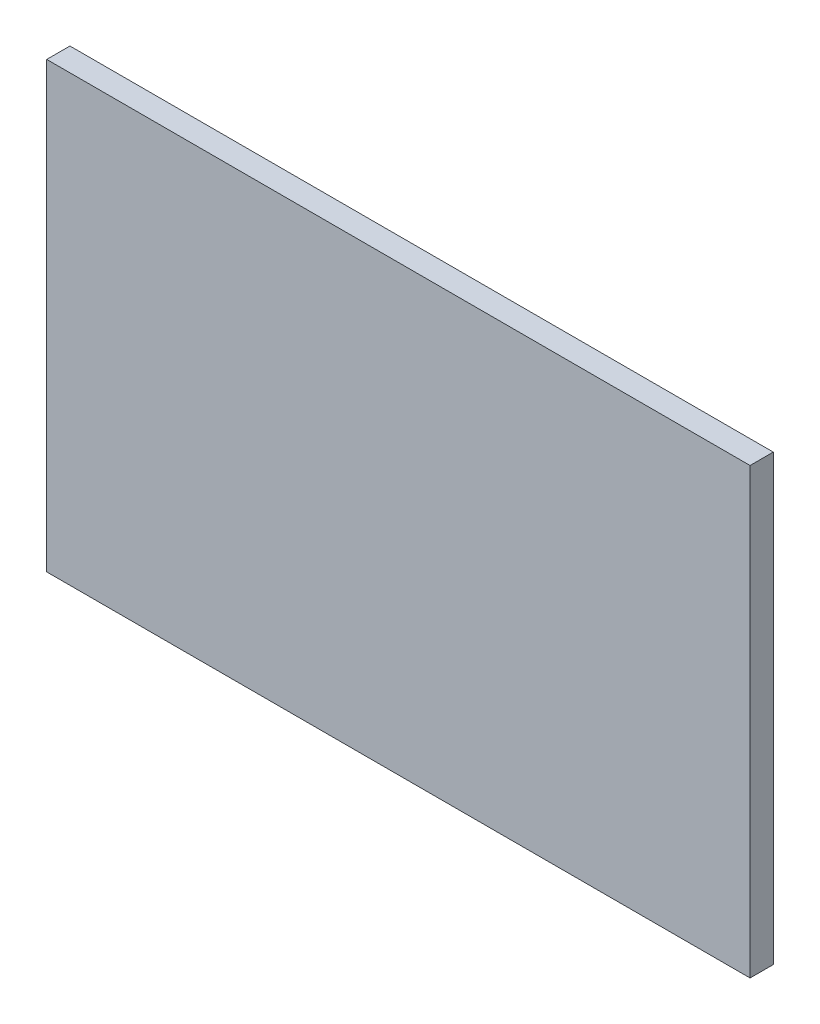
ISO-10303-21;
HEADER;
FILE_DESCRIPTION(('STEP AP214'),'2;1');
FILE_NAME('part.step','',(''),(''),'','','');
FILE_SCHEMA(('AUTOMOTIVE_DESIGN { 1 0 10303 214 1 1 1 1 }'));
ENDSEC;
DATA;
#1=APPLICATION_CONTEXT('core data for automotive mechanical design processes');
#2=APPLICATION_PROTOCOL_DEFINITION('international standard','automotive_design',2000,#1);
#3=PRODUCT_CONTEXT('',#1,'mechanical');
#4=PRODUCT('Part','Part','',(#3));
#5=PRODUCT_RELATED_PRODUCT_CATEGORY('part','',(#4));
#6=PRODUCT_DEFINITION_FORMATION('','',#4);
#7=PRODUCT_DEFINITION_CONTEXT('part definition',#1,'design');
#8=PRODUCT_DEFINITION('design','',#6,#7);
#9=PRODUCT_DEFINITION_SHAPE('','',#8);
#10=(LENGTH_UNIT() NAMED_UNIT(*) SI_UNIT(.MILLI.,.METRE.));
#11=(NAMED_UNIT(*) PLANE_ANGLE_UNIT() SI_UNIT($,.RADIAN.));
#12=(NAMED_UNIT(*) SI_UNIT($,.STERADIAN.) SOLID_ANGLE_UNIT());
#13=UNCERTAINTY_MEASURE_WITH_UNIT(LENGTH_MEASURE(1.E-05),#10,'distance_accuracy_value','');
#14=(GEOMETRIC_REPRESENTATION_CONTEXT(3) GLOBAL_UNCERTAINTY_ASSIGNED_CONTEXT((#13)) GLOBAL_UNIT_ASSIGNED_CONTEXT((#10,
#11,#12)) REPRESENTATION_CONTEXT('',''));
#15=CARTESIAN_POINT('',(0.,0.,0.));
#16=DIRECTION('',(0.,0.,1.));
#17=DIRECTION('',(1.,0.,0.));
#18=AXIS2_PLACEMENT_3D('',#15,#16,#17);
#19=CARTESIAN_POINT('',(154.5,97.5,5.1));
#20=DIRECTION('',(-1.,0.,0.));
#21=DIRECTION('',(0.,-1.,0.));
#22=AXIS2_PLACEMENT_3D('',#19,#20,#21);
#23=PLANE('',#22);
#24=DIRECTION('',(0.,1.,0.));
#25=VECTOR('',#24,1.);
#26=CARTESIAN_POINT('',(154.5,97.5,-5.1));
#27=LINE('',#26,#25);
#28=CARTESIAN_POINT('',(154.5,-97.5,-5.1));
#29=VERTEX_POINT('',#28);
#30=CARTESIAN_POINT('',(154.5,97.5,-5.1));
#31=VERTEX_POINT('',#30);
#32=EDGE_CURVE('E96',#29,#31,#27,.T.);
#33=ORIENTED_EDGE('',*,*,#32,.T.);
#34=DIRECTION('',(0.,0.,-1.));
#35=VECTOR('',#34,1.);
#36=CARTESIAN_POINT('',(154.5,97.5,5.1));
#37=LINE('',#36,#35);
#38=CARTESIAN_POINT('',(154.5,97.5,5.1));
#39=VERTEX_POINT('',#38);
#40=EDGE_CURVE('E11',#39,#31,#37,.T.);
#41=ORIENTED_EDGE('',*,*,#40,.F.);
#42=DIRECTION('',(0.,1.,0.));
#43=VECTOR('',#42,1.);
#44=CARTESIAN_POINT('',(154.5,97.5,5.1));
#45=LINE('',#44,#43);
#46=CARTESIAN_POINT('',(154.5,-97.5,5.1));
#47=VERTEX_POINT('',#46);
#48=EDGE_CURVE('E84',#47,#39,#45,.T.);
#49=ORIENTED_EDGE('',*,*,#48,.F.);
#50=DIRECTION('',(0.,0.,-1.));
#51=VECTOR('',#50,1.);
#52=CARTESIAN_POINT('',(154.5,-97.5,5.1));
#53=LINE('',#52,#51);
#54=EDGE_CURVE('E92',#47,#29,#53,.T.);
#55=ORIENTED_EDGE('',*,*,#54,.T.);
#56=EDGE_LOOP('',(#33,#41,#49,#55));
#57=FACE_BOUND('',#56,.T.);
#58=ADVANCED_FACE('F33',(#57),#23,.F.);
#59=CARTESIAN_POINT('',(-154.5,97.5,5.1));
#60=DIRECTION('',(0.,-1.,0.));
#61=DIRECTION('',(0.,0.,-1.));
#62=AXIS2_PLACEMENT_3D('',#59,#60,#61);
#63=PLANE('',#62);
#64=DIRECTION('',(-1.,0.,0.));
#65=VECTOR('',#64,1.);
#66=CARTESIAN_POINT('',(-154.5,97.5,-5.1));
#67=LINE('',#66,#65);
#68=CARTESIAN_POINT('',(-154.5,97.5,-5.1));
#69=VERTEX_POINT('',#68);
#70=EDGE_CURVE('E88',#31,#69,#67,.T.);
#71=ORIENTED_EDGE('',*,*,#70,.T.);
#72=DIRECTION('',(0.,0.,-1.));
#73=VECTOR('',#72,1.);
#74=CARTESIAN_POINT('',(-154.5,97.5,5.1));
#75=LINE('',#74,#73);
#76=CARTESIAN_POINT('',(-154.5,97.5,5.1));
#77=VERTEX_POINT('',#76);
#78=EDGE_CURVE('E41',#77,#69,#75,.T.);
#79=ORIENTED_EDGE('',*,*,#78,.F.);
#80=DIRECTION('',(-1.,0.,0.));
#81=VECTOR('',#80,1.);
#82=CARTESIAN_POINT('',(-154.5,97.5,5.1));
#83=LINE('',#82,#81);
#84=EDGE_CURVE('E79',#39,#77,#83,.T.);
#85=ORIENTED_EDGE('',*,*,#84,.F.);
#86=ORIENTED_EDGE('',*,*,#40,.T.);
#87=EDGE_LOOP('',(#71,#79,#85,#86));
#88=FACE_BOUND('',#87,.T.);
#89=ADVANCED_FACE('F87',(#88),#63,.F.);
#90=CARTESIAN_POINT('',(-154.5,97.5,5.1));
#91=DIRECTION('',(1.,0.,0.));
#92=DIRECTION('',(0.,1.,0.));
#93=AXIS2_PLACEMENT_3D('',#90,#91,#92);
#94=PLANE('',#93);
#95=DIRECTION('',(0.,-1.,0.));
#96=VECTOR('',#95,1.);
#97=CARTESIAN_POINT('',(-154.5,97.5,-5.1));
#98=LINE('',#97,#96);
#99=CARTESIAN_POINT('',(-154.5,-97.5,-5.1));
#100=VERTEX_POINT('',#99);
#101=EDGE_CURVE('E66',#69,#100,#98,.T.);
#102=ORIENTED_EDGE('',*,*,#101,.T.);
#103=DIRECTION('',(0.,0.,-1.));
#104=VECTOR('',#103,1.);
#105=CARTESIAN_POINT('',(-154.5,-97.5,5.1));
#106=LINE('',#105,#104);
#107=CARTESIAN_POINT('',(-154.5,-97.5,5.1));
#108=VERTEX_POINT('',#107);
#109=EDGE_CURVE('E89',#108,#100,#106,.T.);
#110=ORIENTED_EDGE('',*,*,#109,.F.);
#111=DIRECTION('',(0.,-1.,0.));
#112=VECTOR('',#111,1.);
#113=CARTESIAN_POINT('',(-154.5,97.5,5.1));
#114=LINE('',#113,#112);
#115=EDGE_CURVE('E82',#77,#108,#114,.T.);
#116=ORIENTED_EDGE('',*,*,#115,.F.);
#117=ORIENTED_EDGE('',*,*,#78,.T.);
#118=EDGE_LOOP('',(#102,#110,#116,#117));
#119=FACE_BOUND('',#118,.T.);
#120=ADVANCED_FACE('F90',(#119),#94,.F.);
#121=CARTESIAN_POINT('',(-154.5,-97.5,5.1));
#122=DIRECTION('',(0.,1.,0.));
#123=DIRECTION('',(0.,0.,1.));
#124=AXIS2_PLACEMENT_3D('',#121,#122,#123);
#125=PLANE('',#124);
#126=DIRECTION('',(1.,0.,0.));
#127=VECTOR('',#126,1.);
#128=CARTESIAN_POINT('',(-154.5,-97.5,-5.1));
#129=LINE('',#128,#127);
#130=EDGE_CURVE('E72',#100,#29,#129,.T.);
#131=ORIENTED_EDGE('',*,*,#130,.T.);
#132=ORIENTED_EDGE('',*,*,#54,.F.);
#133=DIRECTION('',(1.,0.,0.));
#134=VECTOR('',#133,1.);
#135=CARTESIAN_POINT('',(-154.5,-97.5,5.1));
#136=LINE('',#135,#134);
#137=EDGE_CURVE('E49',#108,#47,#136,.T.);
#138=ORIENTED_EDGE('',*,*,#137,.F.);
#139=ORIENTED_EDGE('',*,*,#109,.T.);
#140=EDGE_LOOP('',(#131,#132,#138,#139));
#141=FACE_BOUND('',#140,.T.);
#142=ADVANCED_FACE('F103',(#141),#125,.F.);
#143=CARTESIAN_POINT('',(0.,0.,5.1));
#144=DIRECTION('',(0.,0.,1.));
#145=DIRECTION('',(1.,0.,0.));
#146=AXIS2_PLACEMENT_3D('',#143,#144,#145);
#147=PLANE('',#146);
#148=ORIENTED_EDGE('',*,*,#48,.T.);
#149=ORIENTED_EDGE('',*,*,#84,.T.);
#150=ORIENTED_EDGE('',*,*,#115,.T.);
#151=ORIENTED_EDGE('',*,*,#137,.T.);
#152=EDGE_LOOP('',(#148,#149,#150,#151));
#153=FACE_BOUND('',#152,.T.);
#154=ADVANCED_FACE('F80',(#153),#147,.T.);
#155=CARTESIAN_POINT('',(0.,0.,-5.1));
#156=DIRECTION('',(0.,0.,1.));
#157=DIRECTION('',(1.,0.,0.));
#158=AXIS2_PLACEMENT_3D('',#155,#156,#157);
#159=PLANE('',#158);
#160=ORIENTED_EDGE('',*,*,#32,.F.);
#161=ORIENTED_EDGE('',*,*,#130,.F.);
#162=ORIENTED_EDGE('',*,*,#101,.F.);
#163=ORIENTED_EDGE('',*,*,#70,.F.);
#164=EDGE_LOOP('',(#160,#161,#162,#163));
#165=FACE_BOUND('',#164,.T.);
#166=ADVANCED_FACE('F106',(#165),#159,.F.);
#167=CLOSED_SHELL('',(#58,#89,#120,#142,#154,#166));
#168=MANIFOLD_SOLID_BREP('B2',#167);
#169=ADVANCED_BREP_SHAPE_REPRESENTATION('',(#18,#168),#14);
#170=SHAPE_DEFINITION_REPRESENTATION(#9,#169);
ENDSEC;
END-ISO-10303-21;
